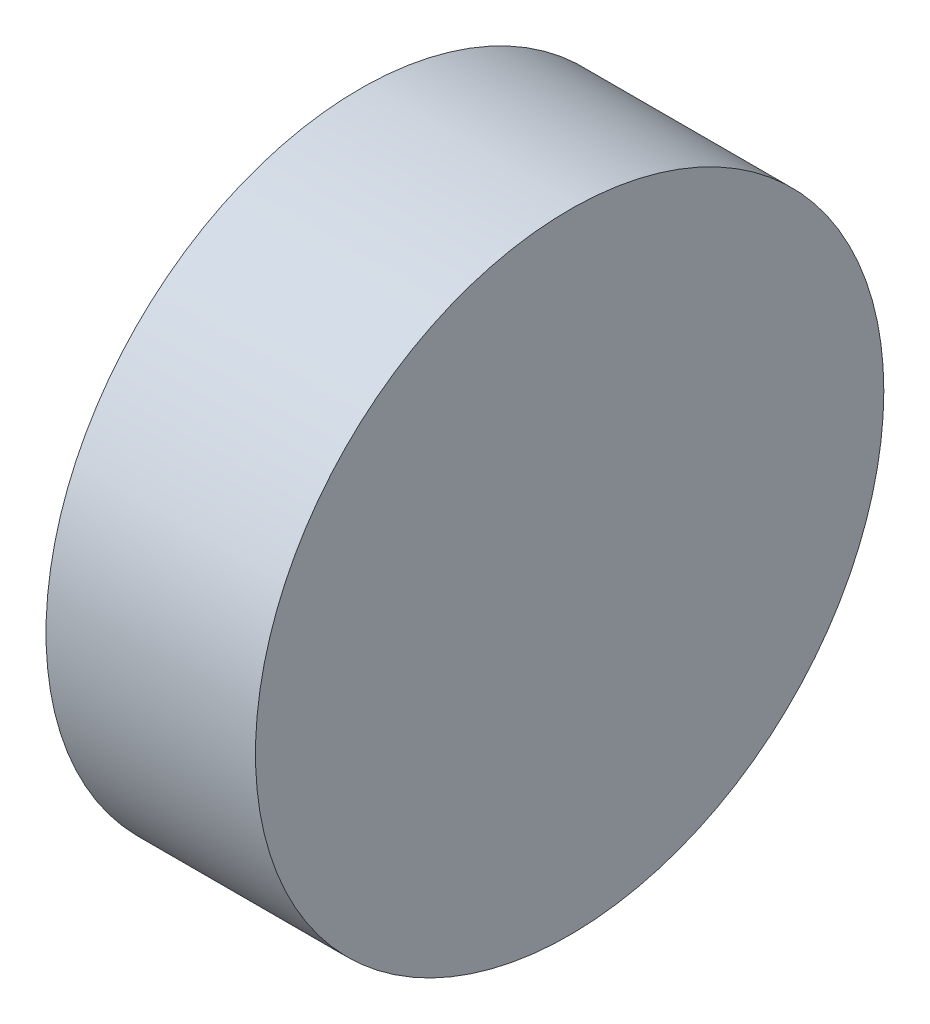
from build123d import *

# Parameters (mm, degrees)
SKETCH1_R           = 45
BOSS_EXTRUDE1_DEPTH = 30


with BuildPart() as part:
    # Sketch1 → Boss-Extrude1 (new body)
    with BuildSketch(Plane(origin=(0, 0, 0), x_dir=(0, 0, -1), z_dir=(1, 0, 0))):
        Circle(SKETCH1_R)
    extrude(amount=BOSS_EXTRUDE1_DEPTH)


solid = part.part
